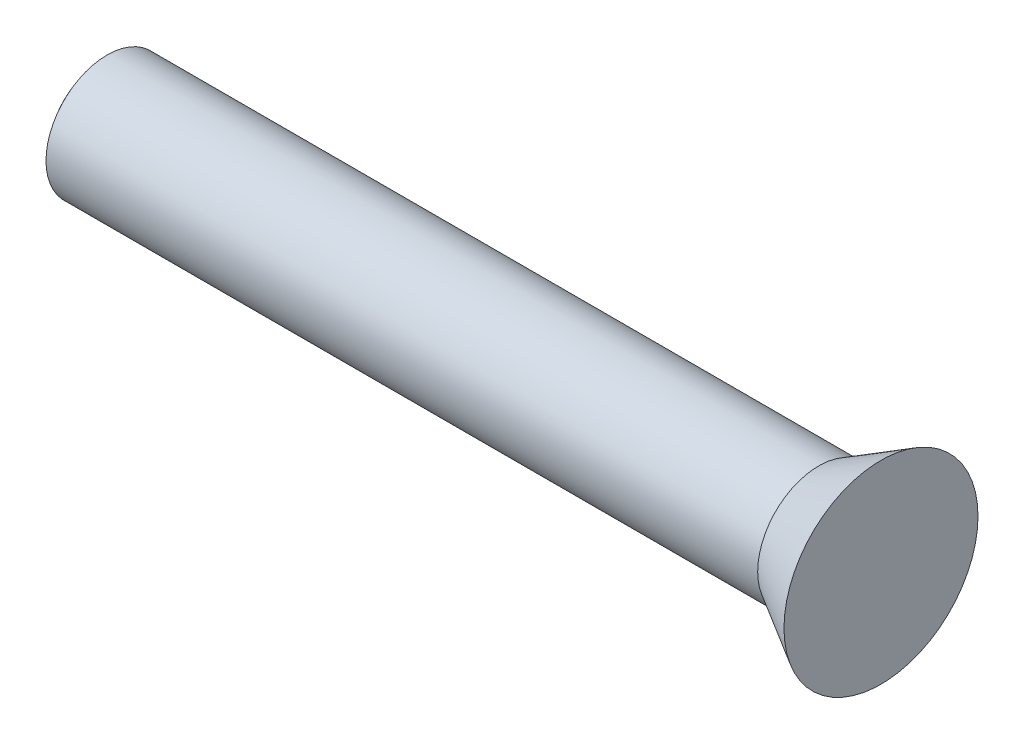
from build123d import *


with BuildPart() as part:
    # Sketch1 → Revolve1 (revolve)
    with BuildSketch(Plane.XY, mode=Mode.PRIVATE) as revolve1_sk:
        with BuildLine():
            Line((0, 0), (10.414, 0))
            Line((10.414, 0), (10.414, 1.27))
            Line((10.414, 1.27), (9.59993612, 0.8))
            Line((9.59993612, 0.8), (0.283643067, 0.8))
            ThreePointArc((0.283643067, 0.8), (0.073009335, 0.424397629), (0, 0))
        make_face()
    revolve(revolve1_sk.sketch.rotate(Axis((0, 0, 0), (1, 0, 0)), 90), axis=Axis((0, 0, 0), (1, 0, 0)))


solid = part.part
